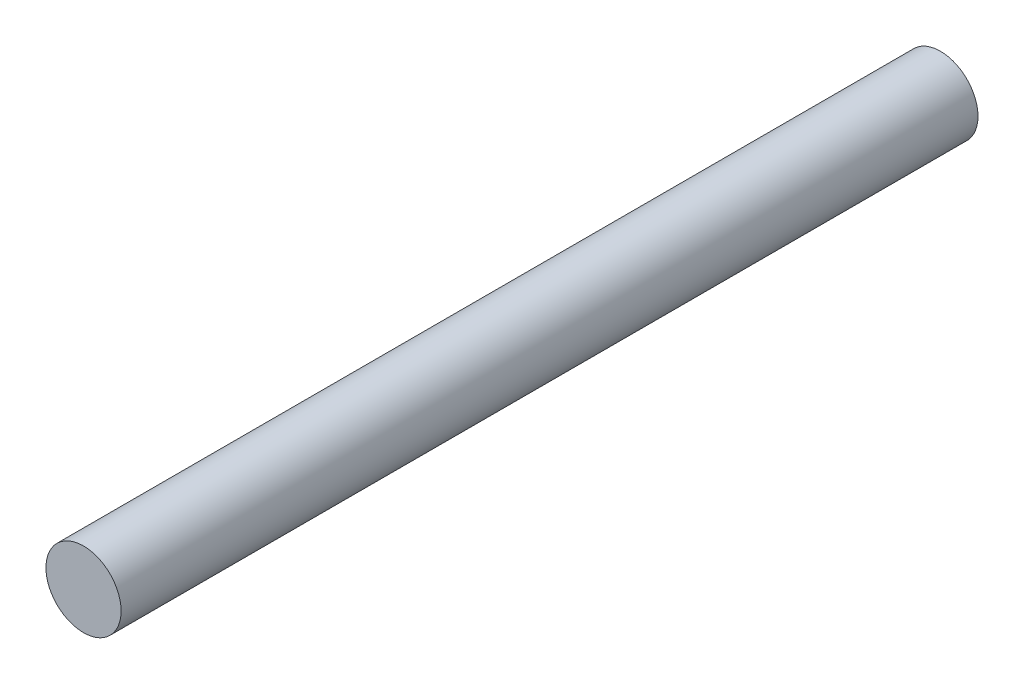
ISO-10303-21;
HEADER;
FILE_DESCRIPTION(('STEP AP214'),'2;1');
FILE_NAME('part.step','',(''),(''),'','','');
FILE_SCHEMA(('AUTOMOTIVE_DESIGN { 1 0 10303 214 1 1 1 1 }'));
ENDSEC;
DATA;
#1=APPLICATION_CONTEXT('core data for automotive mechanical design processes');
#2=APPLICATION_PROTOCOL_DEFINITION('international standard','automotive_design',2000,#1);
#3=PRODUCT_CONTEXT('',#1,'mechanical');
#4=PRODUCT('Part','Part','',(#3));
#5=PRODUCT_RELATED_PRODUCT_CATEGORY('part','',(#4));
#6=PRODUCT_DEFINITION_FORMATION('','',#4);
#7=PRODUCT_DEFINITION_CONTEXT('part definition',#1,'design');
#8=PRODUCT_DEFINITION('design','',#6,#7);
#9=PRODUCT_DEFINITION_SHAPE('','',#8);
#10=(LENGTH_UNIT() NAMED_UNIT(*) SI_UNIT(.MILLI.,.METRE.));
#11=(NAMED_UNIT(*) PLANE_ANGLE_UNIT() SI_UNIT($,.RADIAN.));
#12=(NAMED_UNIT(*) SI_UNIT($,.STERADIAN.) SOLID_ANGLE_UNIT());
#13=UNCERTAINTY_MEASURE_WITH_UNIT(LENGTH_MEASURE(1.E-05),#10,'distance_accuracy_value','');
#14=(GEOMETRIC_REPRESENTATION_CONTEXT(3) GLOBAL_UNCERTAINTY_ASSIGNED_CONTEXT((#13)) GLOBAL_UNIT_ASSIGNED_CONTEXT((#10,
#11,#12)) REPRESENTATION_CONTEXT('',''));
#15=CARTESIAN_POINT('',(0.,0.,0.));
#16=DIRECTION('',(0.,0.,1.));
#17=DIRECTION('',(1.,0.,0.));
#18=AXIS2_PLACEMENT_3D('',#15,#16,#17);
#19=CARTESIAN_POINT('',(0.,0.,0.));
#20=DIRECTION('',(0.,0.,1.));
#21=DIRECTION('',(1.,0.,0.));
#22=AXIS2_PLACEMENT_3D('',#19,#20,#21);
#23=CYLINDRICAL_SURFACE('',#22,1.25);
#24=CARTESIAN_POINT('',(0.,0.,0.));
#25=DIRECTION('',(0.,0.,1.));
#26=DIRECTION('',(1.,0.,0.));
#27=AXIS2_PLACEMENT_3D('',#24,#25,#26);
#28=CIRCLE('',#27,1.25);
#29=CARTESIAN_POINT('',(1.25,0.,0.));
#30=VERTEX_POINT('',#29);
#31=EDGE_CURVE('E8',#30,#30,#28,.T.);
#32=ORIENTED_EDGE('',*,*,#31,.T.);
#33=EDGE_LOOP('',(#32));
#34=FACE_BOUND('',#33,.T.);
#35=CARTESIAN_POINT('',(0.,0.,28.5));
#36=DIRECTION('',(0.,0.,1.));
#37=DIRECTION('',(1.,0.,0.));
#38=AXIS2_PLACEMENT_3D('',#35,#36,#37);
#39=CIRCLE('',#38,1.25);
#40=CARTESIAN_POINT('',(1.25,0.,28.5));
#41=VERTEX_POINT('',#40);
#42=EDGE_CURVE('E18',#41,#41,#39,.T.);
#43=ORIENTED_EDGE('',*,*,#42,.F.);
#44=EDGE_LOOP('',(#43));
#45=FACE_BOUND('',#44,.T.);
#46=ADVANCED_FACE('F12',(#34,#45),#23,.T.);
#47=CARTESIAN_POINT('',(0.,0.,0.));
#48=DIRECTION('',(0.,0.,1.));
#49=DIRECTION('',(1.,0.,0.));
#50=AXIS2_PLACEMENT_3D('',#47,#48,#49);
#51=PLANE('',#50);
#52=ORIENTED_EDGE('',*,*,#31,.F.);
#53=EDGE_LOOP('',(#52));
#54=FACE_BOUND('',#53,.T.);
#55=ADVANCED_FACE('F27',(#54),#51,.F.);
#56=CARTESIAN_POINT('',(0.,0.,28.5));
#57=DIRECTION('',(0.,0.,1.));
#58=DIRECTION('',(1.,0.,0.));
#59=AXIS2_PLACEMENT_3D('',#56,#57,#58);
#60=PLANE('',#59);
#61=ORIENTED_EDGE('',*,*,#42,.T.);
#62=EDGE_LOOP('',(#61));
#63=FACE_BOUND('',#62,.T.);
#64=ADVANCED_FACE('F24',(#63),#60,.T.);
#65=CLOSED_SHELL('',(#46,#55,#64));
#66=MANIFOLD_SOLID_BREP('B1',#65);
#67=ADVANCED_BREP_SHAPE_REPRESENTATION('',(#18,#66),#14);
#68=SHAPE_DEFINITION_REPRESENTATION(#9,#67);
ENDSEC;
END-ISO-10303-21;
